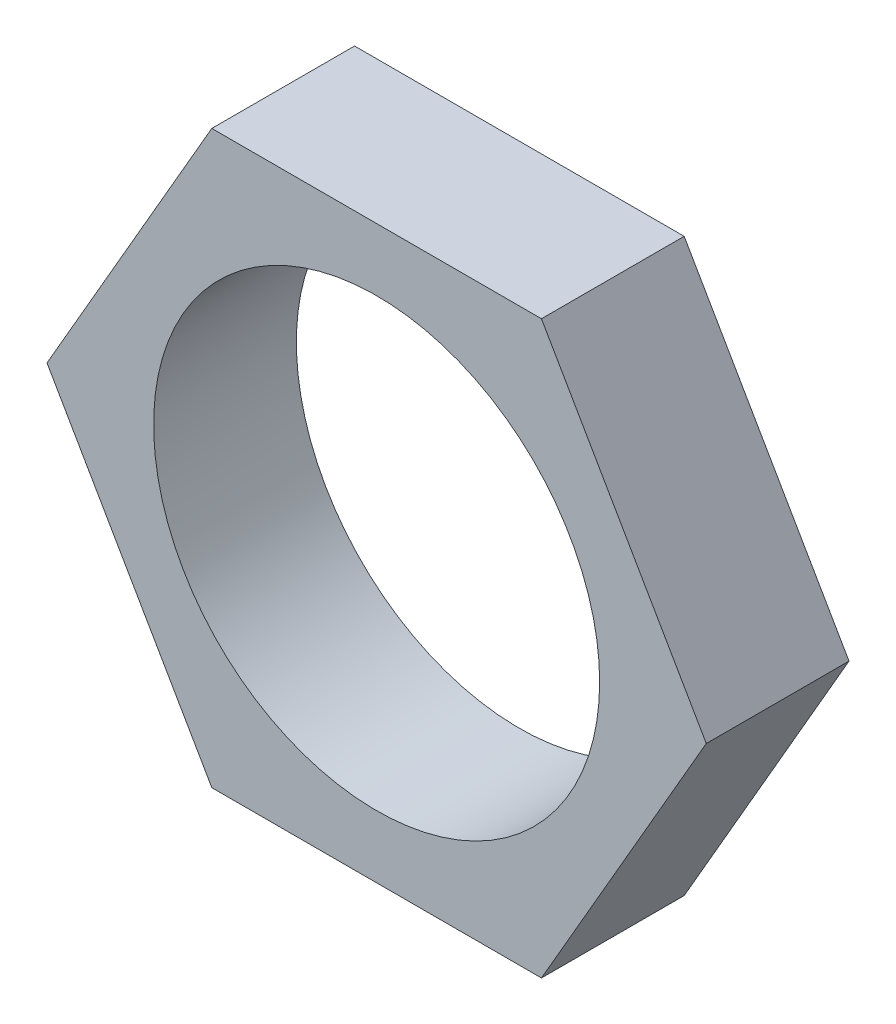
ISO-10303-21;
HEADER;
FILE_DESCRIPTION(('STEP AP214'),'2;1');
FILE_NAME('part.step','',(''),(''),'','','');
FILE_SCHEMA(('AUTOMOTIVE_DESIGN { 1 0 10303 214 1 1 1 1 }'));
ENDSEC;
DATA;
#1=APPLICATION_CONTEXT('core data for automotive mechanical design processes');
#2=APPLICATION_PROTOCOL_DEFINITION('international standard','automotive_design',2000,#1);
#3=PRODUCT_CONTEXT('',#1,'mechanical');
#4=PRODUCT('Part','Part','',(#3));
#5=PRODUCT_RELATED_PRODUCT_CATEGORY('part','',(#4));
#6=PRODUCT_DEFINITION_FORMATION('','',#4);
#7=PRODUCT_DEFINITION_CONTEXT('part definition',#1,'design');
#8=PRODUCT_DEFINITION('design','',#6,#7);
#9=PRODUCT_DEFINITION_SHAPE('','',#8);
#10=(LENGTH_UNIT() NAMED_UNIT(*) SI_UNIT(.MILLI.,.METRE.));
#11=(NAMED_UNIT(*) PLANE_ANGLE_UNIT() SI_UNIT($,.RADIAN.));
#12=(NAMED_UNIT(*) SI_UNIT($,.STERADIAN.) SOLID_ANGLE_UNIT());
#13=UNCERTAINTY_MEASURE_WITH_UNIT(LENGTH_MEASURE(1.E-05),#10,'distance_accuracy_value','');
#14=(GEOMETRIC_REPRESENTATION_CONTEXT(3) GLOBAL_UNCERTAINTY_ASSIGNED_CONTEXT((#13)) GLOBAL_UNIT_ASSIGNED_CONTEXT((#10,
#11,#12)) REPRESENTATION_CONTEXT('',''));
#15=CARTESIAN_POINT('',(0.,0.,0.));
#16=DIRECTION('',(0.,0.,1.));
#17=DIRECTION('',(1.,0.,0.));
#18=AXIS2_PLACEMENT_3D('',#15,#16,#17);
#19=CARTESIAN_POINT('',(9.23760430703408,-16.,-8.00000000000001));
#20=DIRECTION('',(0.866025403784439,-0.5,0.));
#21=DIRECTION('',(0.5,0.866025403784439,0.));
#22=AXIS2_PLACEMENT_3D('',#19,#20,#21);
#23=PLANE('',#22);
#24=DIRECTION('',(0.5,0.866025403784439,0.));
#25=VECTOR('',#24,1.);
#26=CARTESIAN_POINT('',(9.23760430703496,-16.,0.));
#27=LINE('',#26,#25);
#28=CARTESIAN_POINT('',(9.23760430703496,-16.,0.));
#29=VERTEX_POINT('',#28);
#30=CARTESIAN_POINT('',(18.475208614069,3.77475828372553E-12,-3.77475828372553E-12));
#31=VERTEX_POINT('',#30);
#32=EDGE_CURVE('E95',#29,#31,#27,.T.);
#33=ORIENTED_EDGE('',*,*,#32,.F.);
#34=DIRECTION('',(0.,0.,0.999999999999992));
#35=VECTOR('',#34,1.);
#36=CARTESIAN_POINT('',(9.23760430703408,-16.,-8.00000000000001));
#37=LINE('',#36,#35);
#38=CARTESIAN_POINT('',(9.23760430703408,-16.,-8.00000000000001));
#39=VERTEX_POINT('',#38);
#40=EDGE_CURVE('E11',#39,#29,#37,.T.);
#41=ORIENTED_EDGE('',*,*,#40,.F.);
#42=DIRECTION('',(0.5,0.866025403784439,0.));
#43=VECTOR('',#42,1.);
#44=CARTESIAN_POINT('',(9.23760430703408,-16.,-8.00000000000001));
#45=LINE('',#44,#43);
#46=CARTESIAN_POINT('',(18.4752086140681,3.77475828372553E-12,-8.00000000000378));
#47=VERTEX_POINT('',#46);
#48=EDGE_CURVE('E97',#39,#47,#45,.T.);
#49=ORIENTED_EDGE('',*,*,#48,.T.);
#50=DIRECTION('',(0.,0.,0.999999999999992));
#51=VECTOR('',#50,1.);
#52=CARTESIAN_POINT('',(18.4752086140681,3.77475828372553E-12,-8.00000000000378));
#53=LINE('',#52,#51);
#54=EDGE_CURVE('E45',#47,#31,#53,.T.);
#55=ORIENTED_EDGE('',*,*,#54,.T.);
#56=EDGE_LOOP('',(#33,#41,#49,#55));
#57=FACE_BOUND('',#56,.T.);
#58=ADVANCED_FACE('F42',(#57),#23,.T.);
#59=CARTESIAN_POINT('',(-9.23760430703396,-16.,-8.00000000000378));
#60=DIRECTION('',(0.,-1.,0.));
#61=DIRECTION('',(1.,0.,0.));
#62=AXIS2_PLACEMENT_3D('',#59,#60,#61);
#63=PLANE('',#62);
#64=DIRECTION('',(1.,0.,0.));
#65=VECTOR('',#64,1.);
#66=CARTESIAN_POINT('',(-9.23760430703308,-16.,-3.77475828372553E-12));
#67=LINE('',#66,#65);
#68=CARTESIAN_POINT('',(-9.23760430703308,-16.,-3.77475828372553E-12));
#69=VERTEX_POINT('',#68);
#70=EDGE_CURVE('E115',#69,#29,#67,.T.);
#71=ORIENTED_EDGE('',*,*,#70,.F.);
#72=DIRECTION('',(0.,0.,0.999999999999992));
#73=VECTOR('',#72,1.);
#74=CARTESIAN_POINT('',(-9.23760430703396,-16.,-8.00000000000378));
#75=LINE('',#74,#73);
#76=CARTESIAN_POINT('',(-9.23760430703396,-16.,-8.00000000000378));
#77=VERTEX_POINT('',#76);
#78=EDGE_CURVE('E51',#77,#69,#75,.T.);
#79=ORIENTED_EDGE('',*,*,#78,.F.);
#80=DIRECTION('',(1.,0.,0.));
#81=VECTOR('',#80,1.);
#82=CARTESIAN_POINT('',(-9.23760430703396,-16.,-8.00000000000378));
#83=LINE('',#82,#81);
#84=EDGE_CURVE('E103',#77,#39,#83,.T.);
#85=ORIENTED_EDGE('',*,*,#84,.T.);
#86=ORIENTED_EDGE('',*,*,#40,.T.);
#87=EDGE_LOOP('',(#71,#79,#85,#86));
#88=FACE_BOUND('',#87,.T.);
#89=ADVANCED_FACE('F180',(#88),#63,.T.);
#90=CARTESIAN_POINT('',(-18.475208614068,0.,-8.00000000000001));
#91=DIRECTION('',(-0.866025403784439,-0.5,0.));
#92=DIRECTION('',(0.5,-0.866025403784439,0.));
#93=AXIS2_PLACEMENT_3D('',#90,#91,#92);
#94=PLANE('',#93);
#95=DIRECTION('',(0.5,-0.866025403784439,0.));
#96=VECTOR('',#95,1.);
#97=CARTESIAN_POINT('',(-18.4752086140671,0.,0.));
#98=LINE('',#97,#96);
#99=CARTESIAN_POINT('',(-18.4752086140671,0.,0.));
#100=VERTEX_POINT('',#99);
#101=EDGE_CURVE('E133',#100,#69,#98,.T.);
#102=ORIENTED_EDGE('',*,*,#101,.F.);
#103=DIRECTION('',(0.,0.,0.999999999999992));
#104=VECTOR('',#103,1.);
#105=CARTESIAN_POINT('',(-18.475208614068,0.,-8.00000000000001));
#106=LINE('',#105,#104);
#107=CARTESIAN_POINT('',(-18.475208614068,0.,-8.00000000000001));
#108=VERTEX_POINT('',#107);
#109=EDGE_CURVE('E156',#108,#100,#106,.T.);
#110=ORIENTED_EDGE('',*,*,#109,.F.);
#111=DIRECTION('',(0.5,-0.866025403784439,0.));
#112=VECTOR('',#111,1.);
#113=CARTESIAN_POINT('',(-18.475208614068,0.,-8.00000000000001));
#114=LINE('',#113,#112);
#115=EDGE_CURVE('E150',#108,#77,#114,.T.);
#116=ORIENTED_EDGE('',*,*,#115,.T.);
#117=ORIENTED_EDGE('',*,*,#78,.T.);
#118=EDGE_LOOP('',(#102,#110,#116,#117));
#119=FACE_BOUND('',#118,.T.);
#120=ADVANCED_FACE('F184',(#119),#94,.T.);
#121=CARTESIAN_POINT('',(-9.23760430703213,16.,-8.00000000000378));
#122=DIRECTION('',(-0.866025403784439,0.5,0.));
#123=DIRECTION('',(-0.5,-0.866025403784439,0.));
#124=AXIS2_PLACEMENT_3D('',#121,#122,#123);
#125=PLANE('',#124);
#126=DIRECTION('',(-0.5,-0.866025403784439,0.));
#127=VECTOR('',#126,1.);
#128=CARTESIAN_POINT('',(-9.23760430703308,16.,-3.77475828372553E-12));
#129=LINE('',#128,#127);
#130=CARTESIAN_POINT('',(-9.23760430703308,16.,-3.77475828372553E-12));
#131=VERTEX_POINT('',#130);
#132=EDGE_CURVE('E129',#131,#100,#129,.T.);
#133=ORIENTED_EDGE('',*,*,#132,.F.);
#134=DIRECTION('',(0.,0.,0.999999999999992));
#135=VECTOR('',#134,1.);
#136=CARTESIAN_POINT('',(-9.23760430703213,16.,-8.00000000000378));
#137=LINE('',#136,#135);
#138=CARTESIAN_POINT('',(-9.23760430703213,16.,-8.00000000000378));
#139=VERTEX_POINT('',#138);
#140=EDGE_CURVE('E159',#139,#131,#137,.T.);
#141=ORIENTED_EDGE('',*,*,#140,.F.);
#142=DIRECTION('',(-0.5,-0.866025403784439,0.));
#143=VECTOR('',#142,1.);
#144=CARTESIAN_POINT('',(-9.23760430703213,16.,-8.00000000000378));
#145=LINE('',#144,#143);
#146=EDGE_CURVE('E146',#139,#108,#145,.T.);
#147=ORIENTED_EDGE('',*,*,#146,.T.);
#148=ORIENTED_EDGE('',*,*,#109,.T.);
#149=EDGE_LOOP('',(#133,#141,#147,#148));
#150=FACE_BOUND('',#149,.T.);
#151=ADVANCED_FACE('F189',(#150),#125,.T.);
#152=CARTESIAN_POINT('',(9.23760430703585,16.,-8.00000000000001));
#153=DIRECTION('',(0.,1.,0.));
#154=DIRECTION('',(0.,0.,0.999999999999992));
#155=AXIS2_PLACEMENT_3D('',#152,#153,#154);
#156=PLANE('',#155);
#157=DIRECTION('',(-1.,0.,0.));
#158=VECTOR('',#157,1.);
#159=CARTESIAN_POINT('',(9.23760430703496,16.,0.));
#160=LINE('',#159,#158);
#161=CARTESIAN_POINT('',(9.23760430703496,16.,0.));
#162=VERTEX_POINT('',#161);
#163=EDGE_CURVE('E111',#162,#131,#160,.T.);
#164=ORIENTED_EDGE('',*,*,#163,.F.);
#165=DIRECTION('',(0.,0.,0.999999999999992));
#166=VECTOR('',#165,1.);
#167=CARTESIAN_POINT('',(9.23760430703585,16.,-8.00000000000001));
#168=LINE('',#167,#166);
#169=CARTESIAN_POINT('',(9.23760430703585,16.,-8.00000000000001));
#170=VERTEX_POINT('',#169);
#171=EDGE_CURVE('E102',#170,#162,#168,.T.);
#172=ORIENTED_EDGE('',*,*,#171,.F.);
#173=DIRECTION('',(-1.,0.,0.));
#174=VECTOR('',#173,1.);
#175=CARTESIAN_POINT('',(9.23760430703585,16.,-8.00000000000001));
#176=LINE('',#175,#174);
#177=EDGE_CURVE('E142',#170,#139,#176,.T.);
#178=ORIENTED_EDGE('',*,*,#177,.T.);
#179=ORIENTED_EDGE('',*,*,#140,.T.);
#180=EDGE_LOOP('',(#164,#172,#178,#179));
#181=FACE_BOUND('',#180,.T.);
#182=ADVANCED_FACE('F195',(#181),#156,.T.);
#183=CARTESIAN_POINT('',(18.4752086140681,3.77475828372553E-12,-8.00000000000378));
#184=DIRECTION('',(0.866025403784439,0.5,0.));
#185=DIRECTION('',(-0.5,0.866025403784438,0.));
#186=AXIS2_PLACEMENT_3D('',#183,#184,#185);
#187=PLANE('',#186);
#188=DIRECTION('',(-0.5,0.866025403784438,0.));
#189=VECTOR('',#188,1.);
#190=CARTESIAN_POINT('',(18.475208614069,3.77475828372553E-12,-3.77475828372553E-12));
#191=LINE('',#190,#189);
#192=EDGE_CURVE('E105',#31,#162,#191,.T.);
#193=ORIENTED_EDGE('',*,*,#192,.F.);
#194=ORIENTED_EDGE('',*,*,#54,.F.);
#195=DIRECTION('',(-0.5,0.866025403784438,0.));
#196=VECTOR('',#195,1.);
#197=CARTESIAN_POINT('',(18.4752086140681,3.77475828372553E-12,-8.00000000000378));
#198=LINE('',#197,#196);
#199=EDGE_CURVE('E139',#47,#170,#198,.T.);
#200=ORIENTED_EDGE('',*,*,#199,.T.);
#201=ORIENTED_EDGE('',*,*,#171,.T.);
#202=EDGE_LOOP('',(#193,#194,#200,#201));
#203=FACE_BOUND('',#202,.T.);
#204=ADVANCED_FACE('F106',(#203),#187,.T.);
#205=CARTESIAN_POINT('',(18.4752086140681,3.77475828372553E-12,-8.00000000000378));
#206=DIRECTION('',(0.,0.,0.999999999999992));
#207=DIRECTION('',(1.,0.,0.));
#208=AXIS2_PLACEMENT_3D('',#205,#206,#207);
#209=PLANE('',#208);
#210=CARTESIAN_POINT('',(0.,0.,-8.00000000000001));
#211=DIRECTION('',(0.,0.,0.999999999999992));
#212=DIRECTION('',(1.,0.,0.));
#213=AXIS2_PLACEMENT_3D('',#210,#211,#212);
#214=CIRCLE('',#213,12.5);
#215=CARTESIAN_POINT('',(12.5000000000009,0.,-8.00000000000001));
#216=VERTEX_POINT('',#215);
#217=EDGE_CURVE('E117',#216,#216,#214,.T.);
#218=ORIENTED_EDGE('',*,*,#217,.T.);
#219=EDGE_LOOP('',(#218));
#220=FACE_BOUND('',#219,.T.);
#221=ORIENTED_EDGE('',*,*,#48,.F.);
#222=ORIENTED_EDGE('',*,*,#84,.F.);
#223=ORIENTED_EDGE('',*,*,#115,.F.);
#224=ORIENTED_EDGE('',*,*,#146,.F.);
#225=ORIENTED_EDGE('',*,*,#177,.F.);
#226=ORIENTED_EDGE('',*,*,#199,.F.);
#227=EDGE_LOOP('',(#221,#222,#223,#224,#225,#226));
#228=FACE_BOUND('',#227,.T.);
#229=ADVANCED_FACE('F169',(#220,#228),#209,.F.);
#230=CARTESIAN_POINT('',(18.475208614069,3.77475828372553E-12,-3.77475828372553E-12));
#231=DIRECTION('',(0.,0.,0.999999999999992));
#232=DIRECTION('',(1.,0.,0.));
#233=AXIS2_PLACEMENT_3D('',#230,#231,#232);
#234=PLANE('',#233);
#235=CARTESIAN_POINT('',(9.43689570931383E-13,0.,0.));
#236=DIRECTION('',(0.,0.,0.999999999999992));
#237=DIRECTION('',(1.,0.,0.));
#238=AXIS2_PLACEMENT_3D('',#235,#236,#237);
#239=CIRCLE('',#238,12.5);
#240=CARTESIAN_POINT('',(12.5000000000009,0.,0.));
#241=VERTEX_POINT('',#240);
#242=EDGE_CURVE('E123',#241,#241,#239,.T.);
#243=ORIENTED_EDGE('',*,*,#242,.F.);
#244=EDGE_LOOP('',(#243));
#245=FACE_BOUND('',#244,.T.);
#246=ORIENTED_EDGE('',*,*,#32,.T.);
#247=ORIENTED_EDGE('',*,*,#192,.T.);
#248=ORIENTED_EDGE('',*,*,#163,.T.);
#249=ORIENTED_EDGE('',*,*,#132,.T.);
#250=ORIENTED_EDGE('',*,*,#101,.T.);
#251=ORIENTED_EDGE('',*,*,#70,.T.);
#252=EDGE_LOOP('',(#246,#247,#248,#249,#250,#251));
#253=FACE_BOUND('',#252,.T.);
#254=ADVANCED_FACE('F113',(#245,#253),#234,.T.);
#255=CARTESIAN_POINT('',(9.43689570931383E-13,0.,0.));
#256=DIRECTION('',(0.,0.,0.999999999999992));
#257=DIRECTION('',(1.,0.,0.));
#258=AXIS2_PLACEMENT_3D('',#255,#256,#257);
#259=CYLINDRICAL_SURFACE('',#258,12.5);
#260=CARTESIAN_POINT('',(12.5000000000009,0.,-8.00000000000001));
#261=CARTESIAN_POINT('',(12.5000000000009,0.,-7.91666666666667));
#262=CARTESIAN_POINT('',(12.5000000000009,0.,-7.83333333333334));
#263=CARTESIAN_POINT('',(12.5000000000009,0.,-7.66666666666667));
#264=CARTESIAN_POINT('',(12.5000000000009,0.,-7.58333333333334));
#265=CARTESIAN_POINT('',(12.5000000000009,0.,-7.41666666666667));
#266=CARTESIAN_POINT('',(12.5000000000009,0.,-7.33333333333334));
#267=CARTESIAN_POINT('',(12.5000000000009,0.,-7.16666666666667));
#268=CARTESIAN_POINT('',(12.5000000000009,0.,-7.08333333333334));
#269=CARTESIAN_POINT('',(12.5000000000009,0.,-6.91666666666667));
#270=CARTESIAN_POINT('',(12.5000000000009,0.,-6.83333333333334));
#271=CARTESIAN_POINT('',(12.5000000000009,0.,-6.66666666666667));
#272=CARTESIAN_POINT('',(12.5000000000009,0.,-6.58333333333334));
#273=CARTESIAN_POINT('',(12.5000000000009,0.,-6.41666666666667));
#274=CARTESIAN_POINT('',(12.5000000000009,0.,-6.33333333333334));
#275=CARTESIAN_POINT('',(12.5000000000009,0.,-6.16666666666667));
#276=CARTESIAN_POINT('',(12.5000000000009,0.,-6.08333333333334));
#277=CARTESIAN_POINT('',(12.5000000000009,0.,-5.91666666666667));
#278=CARTESIAN_POINT('',(12.5000000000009,0.,-5.83333333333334));
#279=CARTESIAN_POINT('',(12.5000000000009,0.,-5.66666666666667));
#280=CARTESIAN_POINT('',(12.5000000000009,0.,-5.58333333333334));
#281=CARTESIAN_POINT('',(12.5000000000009,0.,-5.41666666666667));
#282=CARTESIAN_POINT('',(12.5000000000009,0.,-5.33333333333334));
#283=CARTESIAN_POINT('',(12.5000000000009,0.,-5.16666666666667));
#284=CARTESIAN_POINT('',(12.5000000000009,0.,-5.08333333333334));
#285=CARTESIAN_POINT('',(12.5000000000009,0.,-4.91666666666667));
#286=CARTESIAN_POINT('',(12.5000000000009,0.,-4.83333333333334));
#287=CARTESIAN_POINT('',(12.5000000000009,0.,-4.66666666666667));
#288=CARTESIAN_POINT('',(12.5000000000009,0.,-4.58333333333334));
#289=CARTESIAN_POINT('',(12.5000000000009,0.,-4.41666666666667));
#290=CARTESIAN_POINT('',(12.5000000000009,0.,-4.33333333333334));
#291=CARTESIAN_POINT('',(12.5000000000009,0.,-4.16666666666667));
#292=CARTESIAN_POINT('',(12.5000000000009,0.,-4.08333333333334));
#293=CARTESIAN_POINT('',(12.5000000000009,0.,-3.91666666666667));
#294=CARTESIAN_POINT('',(12.5000000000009,0.,-3.83333333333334));
#295=CARTESIAN_POINT('',(12.5000000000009,0.,-3.66666666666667));
#296=CARTESIAN_POINT('',(12.5000000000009,0.,-3.58333333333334));
#297=CARTESIAN_POINT('',(12.5000000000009,0.,-3.41666666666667));
#298=CARTESIAN_POINT('',(12.5000000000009,0.,-3.33333333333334));
#299=CARTESIAN_POINT('',(12.5000000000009,0.,-3.16666666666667));
#300=CARTESIAN_POINT('',(12.5000000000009,0.,-3.08333333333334));
#301=CARTESIAN_POINT('',(12.5000000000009,0.,-2.91666666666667));
#302=CARTESIAN_POINT('',(12.5000000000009,0.,-2.83333333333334));
#303=CARTESIAN_POINT('',(12.5000000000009,0.,-2.66666666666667));
#304=CARTESIAN_POINT('',(12.5000000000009,0.,-2.58333333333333));
#305=CARTESIAN_POINT('',(12.5000000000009,0.,-2.41666666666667));
#306=CARTESIAN_POINT('',(12.5000000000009,0.,-2.33333333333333));
#307=CARTESIAN_POINT('',(12.5000000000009,0.,-2.16666666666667));
#308=CARTESIAN_POINT('',(12.5000000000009,0.,-2.08333333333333));
#309=CARTESIAN_POINT('',(12.5000000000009,0.,-1.91666666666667));
#310=CARTESIAN_POINT('',(12.5000000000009,0.,-1.83333333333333));
#311=CARTESIAN_POINT('',(12.5000000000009,0.,-1.66666666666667));
#312=CARTESIAN_POINT('',(12.5000000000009,0.,-1.58333333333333));
#313=CARTESIAN_POINT('',(12.5000000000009,0.,-1.41666666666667));
#314=CARTESIAN_POINT('',(12.5000000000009,0.,-1.33333333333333));
#315=CARTESIAN_POINT('',(12.5000000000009,0.,-1.16666666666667));
#316=CARTESIAN_POINT('',(12.5000000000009,0.,-1.08333333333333));
#317=CARTESIAN_POINT('',(12.5000000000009,0.,-0.916666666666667));
#318=CARTESIAN_POINT('',(12.5000000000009,0.,-0.833333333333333));
#319=CARTESIAN_POINT('',(12.5000000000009,0.,-0.666666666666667));
#320=CARTESIAN_POINT('',(12.5000000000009,0.,-0.583333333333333));
#321=CARTESIAN_POINT('',(12.5000000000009,0.,-0.416666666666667));
#322=CARTESIAN_POINT('',(12.5000000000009,0.,-0.333333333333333));
#323=CARTESIAN_POINT('',(12.5000000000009,0.,-0.166666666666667));
#324=CARTESIAN_POINT('',(12.5000000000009,0.,-0.0833333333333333));
#325=CARTESIAN_POINT('',(12.5000000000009,0.,0.));
#326=B_SPLINE_CURVE_WITH_KNOTS('',3,(#260,#261,#262,#263,#264,#265,#266,#267,#268,#269,#270,
#271,#272,#273,#274,#275,#276,#277,#278,#279,#280,#281,#282,#283,#284,#285,#286,#287,#288,#289,
#290,#291,#292,#293,#294,#295,#296,#297,#298,#299,#300,#301,#302,#303,#304,#305,#306,#307,#308,
#309,#310,#311,#312,#313,#314,#315,#316,#317,#318,#319,#320,#321,#322,#323,#324,#325),
.UNSPECIFIED.,.F.,.F.,(4,2,2,2,2,2,2,2,2,2,2,2,2,2,2,2,2,2,2,2,2,2,2,2,2,2,2,2,2,2,2,2,4),(0.,
0.249999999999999,0.5,0.75,1.,1.25,1.5,1.75,2.,2.25,2.5,2.75,3.,3.25,3.5,3.75,4.,4.25,4.5,4.75,
5.,5.25,5.5,5.75,6.,6.25,6.5,6.75,7.00000000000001,7.25000000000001,7.50000000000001,
7.75000000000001,8.00000000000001),.UNSPECIFIED.);
#327=EDGE_CURVE('BSEAM166',#216,#241,#326,.T.);
#328=ORIENTED_EDGE('',*,*,#217,.F.);
#329=ORIENTED_EDGE('',*,*,#242,.T.);
#330=ORIENTED_EDGE('',*,*,#327,.T.);
#331=ORIENTED_EDGE('',*,*,#327,.F.);
#332=EDGE_LOOP('',(#328,#330,#329,#331));
#333=FACE_BOUND('',#332,.T.);
#334=ADVANCED_FACE('F166',(#333),#259,.F.);
#335=CLOSED_SHELL('',(#58,#89,#120,#151,#182,#204,#229,#254,#334));
#336=MANIFOLD_SOLID_BREP('B2',#335);
#337=ADVANCED_BREP_SHAPE_REPRESENTATION('',(#18,#336),#14);
#338=SHAPE_DEFINITION_REPRESENTATION(#9,#337);
ENDSEC;
END-ISO-10303-21;
